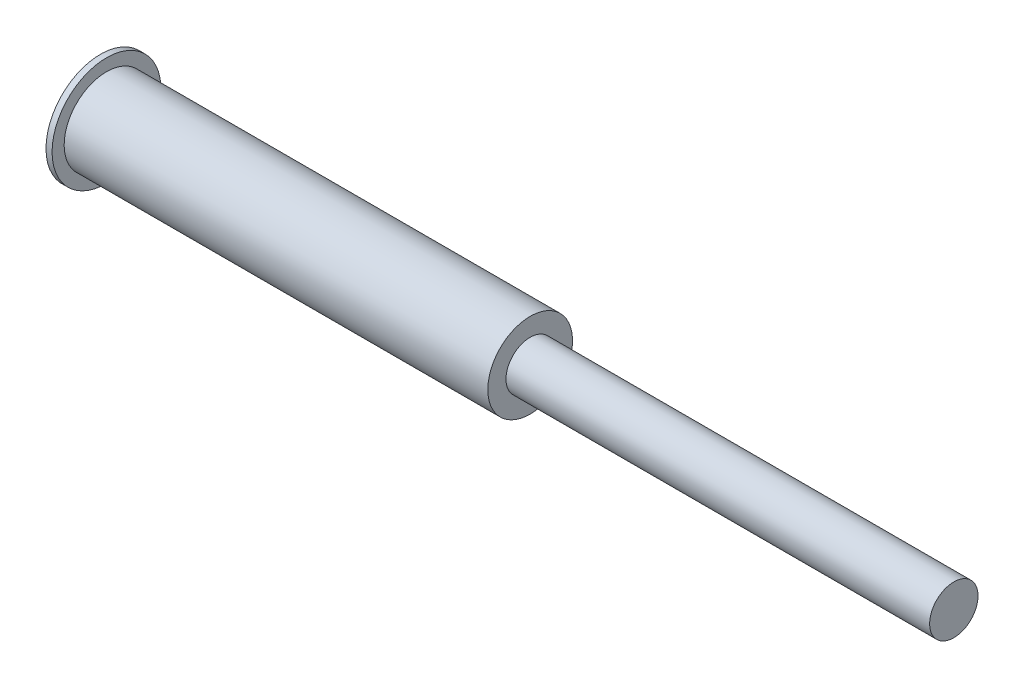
from build123d import *


with BuildPart() as part:
    # Sketch 1 → Revolve 1 (revolve)
    with BuildSketch(Plane.XY, mode=Mode.PRIVATE) as revolve_1_sk:
        Polygon((35.5, 2), (35.5, 3.5), (0.5, 3.5), (0.5, 4.5), (0, 4.5), (0, 0), (35.5, 0), (70.5, 0), (70.5, 2), align=None)
    revolve(revolve_1_sk.sketch.rotate(Axis((0, 0, 0), (1, 0, 0)), 90), axis=Axis((0, 0, 0), (1, 0, 0)))


solid = part.part
